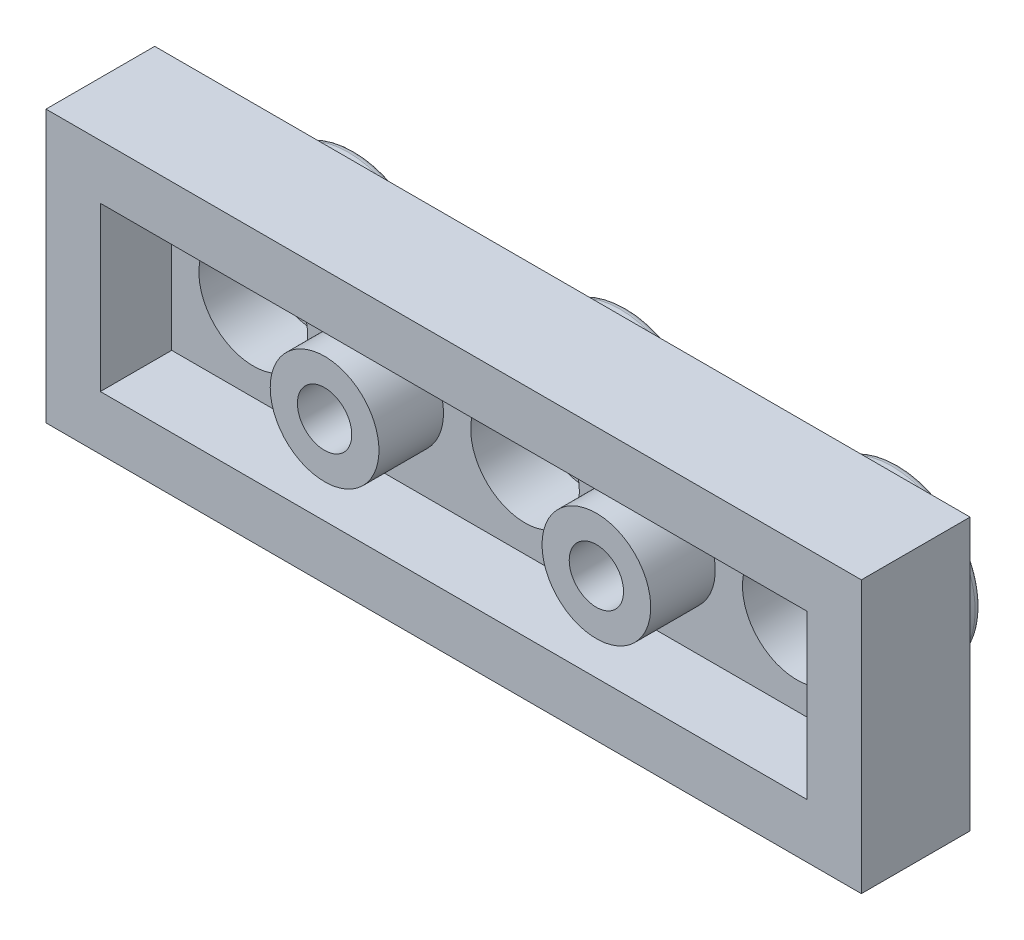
from build123d import *

# Parameters (mm, degrees)
SKIZZE1_W                         = 24
SKIZZE1_H                         = 8
LINEAR_AUSTRAGEN1_DEPTH           = 3.2
SKIZZE2_W                         = 20.8
SKIZZE2_H                         = 4.8
SCHNITT_LINEAR_AUSTRAGEN1_DEPTH   = 2.1
SKIZZE3_R                         = 1.6
SKIZZE3_R_2                       = 0.8
LINEAR_AUSTRAGEN2_DEPTH           = 1.9
SKIZZE4_R                         = 2.45
LINEAR_AUSTRAGEN3_DEPTH           = 1.9
VERRUNDUNG1_R                     = 0.2
SKIZZE9_R                         = 1.6
SCHNITT_LINEAR_AUSTRAGEN2_DEPTH   = 1.8
LINEARES_MUSTER1_COUNT            = 3
LINEARES_MUSTER1_PITCH            = 8
VERRUNDUNG1_OF_LINEARES_MUSTER1_R = 0.2
LINEARES_MUSTER2_COUNT            = 2
LINEARES_MUSTER2_PITCH            = 8


with BuildPart() as part:
    # Skizze1 → Linear austragen1 (new body)
    with BuildSketch(Plane.XY):
        with Locations((-12, -4)):
            Rectangle(SKIZZE1_W, SKIZZE1_H)
    extrude(amount=LINEAR_AUSTRAGEN1_DEPTH)

    # Skizze2 → Schnitt-Linear austragen1 (cut)
    with BuildSketch(Plane.XY.offset(3.2)):
        with Locations((-12, -4)):
            Rectangle(SKIZZE2_W, SKIZZE2_H)
    extrude(amount=-SCHNITT_LINEAR_AUSTRAGEN1_DEPTH, mode=Mode.SUBTRACT)

    # Skizze3 → Linear austragen2 (add)
    with BuildSketch(Plane.XY.offset(1.1)):
        with Locations(Location((-8, -4, 0), (0, 0, 180))):
            Circle(SKIZZE3_R)
        with Locations(Location((-8, -4, 0), (0, 0, 180))):
            Circle(SKIZZE3_R_2, mode=Mode.SUBTRACT)
    linear_austragen2 = extrude(amount=LINEAR_AUSTRAGEN2_DEPTH)

    # Skizze4 → Linear austragen3 (add)
    with BuildSketch(Plane(origin=(0, 0, 0), x_dir=(-1, 0, 0), z_dir=(0, 0, -1))):
        with Locations(Location((4, -4, 0), (0, 0, 180))):
            Circle(SKIZZE4_R)
    linear_austragen3 = extrude(amount=LINEAR_AUSTRAGEN3_DEPTH)

    # Verrundung1
    verrundung1_edges = [part.edges().sort_by_distance(p)[0] for p in [
        (-6.45, -4, -1.9),
    ]]
    fillet(verrundung1_edges, radius=VERRUNDUNG1_R)

    # Skizze9 → Schnitt-Linear austragen2 (cut)
    with BuildSketch(Plane.XY.offset(1.1)):
        with Locations((-4, -4)):
            Circle(SKIZZE9_R)
    schnitt_linear_austragen2 = extrude(amount=-SCHNITT_LINEAR_AUSTRAGEN2_DEPTH, mode=Mode.SUBTRACT)

    # Lineares Muster1: Linear austragen3, Schnitt-Linear austragen2 ×3
    with Locations(*[(-i * LINEARES_MUSTER1_PITCH, 0, 0) for i in range(1, LINEARES_MUSTER1_COUNT)]):
        add(linear_austragen3)
        add(schnitt_linear_austragen2, mode=Mode.SUBTRACT)

    # Verrundung1 of Lineares Muster1
    verrundung1_of_lineares_muster1_edges = [part.edges().sort_by_distance(p)[0] for p in [
        (-14.45, -4, -1.9),
        (-22.45, -4, -1.9),
    ]]
    fillet(verrundung1_of_lineares_muster1_edges, radius=VERRUNDUNG1_OF_LINEARES_MUSTER1_R)

    # Lineares Muster2: Linear austragen2 ×2
    with Locations(*[(-i * LINEARES_MUSTER2_PITCH, 0, 0) for i in range(1, LINEARES_MUSTER2_COUNT)]):
        add(linear_austragen2)


solid = part.part
